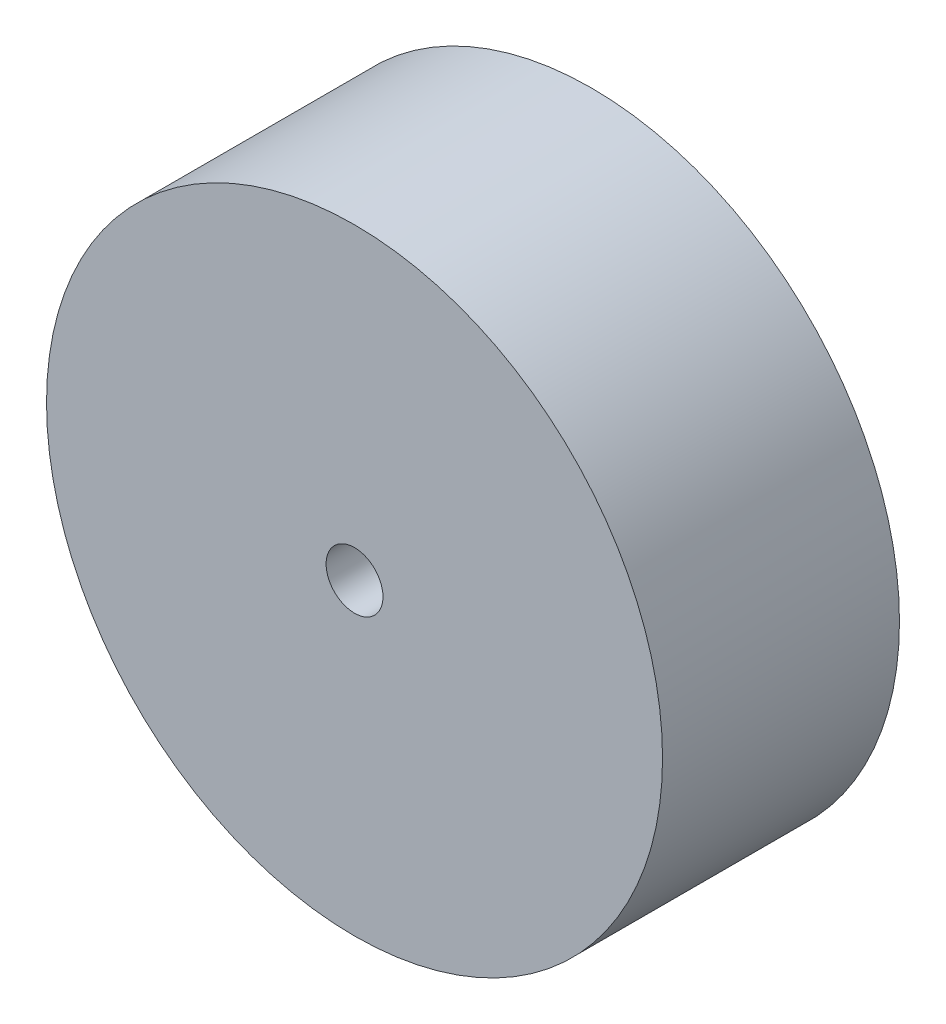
from build123d import *

# Parameters (mm, degrees)
ESQUISSE1_R        = 32.5
ESQUISSE1_R_2      = 3
BOSS_EXTRU_1_DEPTH = 25


with BuildPart() as part:
    # Esquisse1 → Boss.-Extru.1 (new body)
    with BuildSketch(Plane.XY):
        Circle(ESQUISSE1_R)
        Circle(ESQUISSE1_R_2, mode=Mode.SUBTRACT)
    extrude(amount=BOSS_EXTRU_1_DEPTH)


solid = part.part
